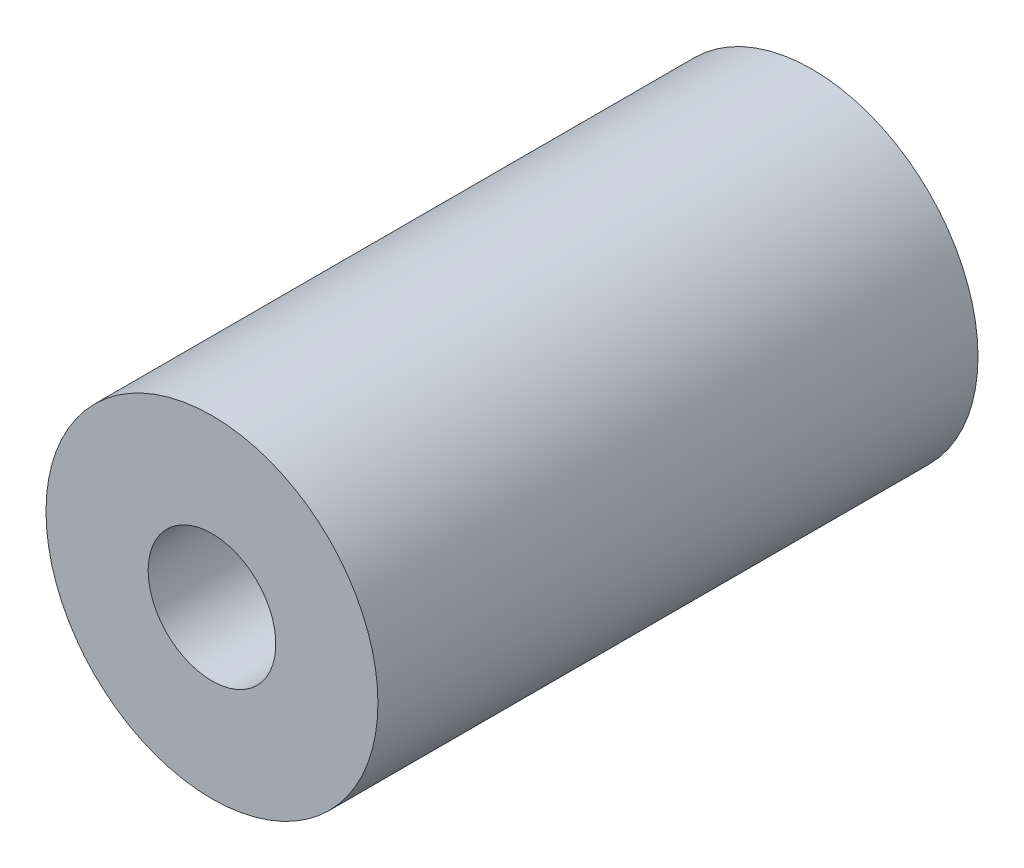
ISO-10303-21;
HEADER;
FILE_DESCRIPTION(('STEP AP214'),'2;1');
FILE_NAME('part.step','',(''),(''),'','','');
FILE_SCHEMA(('AUTOMOTIVE_DESIGN { 1 0 10303 214 1 1 1 1 }'));
ENDSEC;
DATA;
#1=APPLICATION_CONTEXT('core data for automotive mechanical design processes');
#2=APPLICATION_PROTOCOL_DEFINITION('international standard','automotive_design',2000,#1);
#3=PRODUCT_CONTEXT('',#1,'mechanical');
#4=PRODUCT('Part','Part','',(#3));
#5=PRODUCT_RELATED_PRODUCT_CATEGORY('part','',(#4));
#6=PRODUCT_DEFINITION_FORMATION('','',#4);
#7=PRODUCT_DEFINITION_CONTEXT('part definition',#1,'design');
#8=PRODUCT_DEFINITION('design','',#6,#7);
#9=PRODUCT_DEFINITION_SHAPE('','',#8);
#10=(LENGTH_UNIT() NAMED_UNIT(*) SI_UNIT(.MILLI.,.METRE.));
#11=(NAMED_UNIT(*) PLANE_ANGLE_UNIT() SI_UNIT($,.RADIAN.));
#12=(NAMED_UNIT(*) SI_UNIT($,.STERADIAN.) SOLID_ANGLE_UNIT());
#13=UNCERTAINTY_MEASURE_WITH_UNIT(LENGTH_MEASURE(1.E-05),#10,'distance_accuracy_value','');
#14=(GEOMETRIC_REPRESENTATION_CONTEXT(3) GLOBAL_UNCERTAINTY_ASSIGNED_CONTEXT((#13)) GLOBAL_UNIT_ASSIGNED_CONTEXT((#10,
#11,#12)) REPRESENTATION_CONTEXT('',''));
#15=CARTESIAN_POINT('',(0.,0.,0.));
#16=DIRECTION('',(0.,0.,1.));
#17=DIRECTION('',(1.,0.,0.));
#18=AXIS2_PLACEMENT_3D('',#15,#16,#17);
#19=CARTESIAN_POINT('',(0.,0.,45.));
#20=DIRECTION('',(0.,0.,1.));
#21=DIRECTION('',(1.,0.,0.));
#22=AXIS2_PLACEMENT_3D('',#19,#20,#21);
#23=CYLINDRICAL_SURFACE('',#22,6.5);
#24=CARTESIAN_POINT('',(0.,0.,25.));
#25=DIRECTION('',(0.,0.,1.));
#26=DIRECTION('',(1.,0.,0.));
#27=AXIS2_PLACEMENT_3D('',#24,#25,#26);
#28=CIRCLE('',#27,6.5);
#29=CARTESIAN_POINT('',(6.5,0.,25.));
#30=VERTEX_POINT('',#29);
#31=EDGE_CURVE('E8',#30,#30,#28,.T.);
#32=ORIENTED_EDGE('',*,*,#31,.F.);
#33=EDGE_LOOP('',(#32));
#34=FACE_BOUND('',#33,.T.);
#35=CARTESIAN_POINT('',(0.,0.,1.5));
#36=DIRECTION('',(0.,0.,-1.));
#37=DIRECTION('',(-1.,0.,0.));
#38=AXIS2_PLACEMENT_3D('',#35,#36,#37);
#39=CIRCLE('',#38,6.5);
#40=CARTESIAN_POINT('',(-6.5,0.,1.5));
#41=VERTEX_POINT('',#40);
#42=EDGE_CURVE('E28',#41,#41,#39,.F.);
#43=ORIENTED_EDGE('',*,*,#42,.T.);
#44=EDGE_LOOP('',(#43));
#45=FACE_BOUND('',#44,.T.);
#46=ADVANCED_FACE('F12',(#34,#45),#23,.T.);
#47=CARTESIAN_POINT('',(0.,0.,25.));
#48=DIRECTION('',(0.,0.,1.));
#49=DIRECTION('',(1.,0.,0.));
#50=AXIS2_PLACEMENT_3D('',#47,#48,#49);
#51=PLANE('',#50);
#52=ORIENTED_EDGE('',*,*,#31,.T.);
#53=EDGE_LOOP('',(#52));
#54=FACE_BOUND('',#53,.T.);
#55=CARTESIAN_POINT('',(0.,0.,25.));
#56=DIRECTION('',(0.,0.,-1.));
#57=DIRECTION('',(-1.,0.,0.));
#58=AXIS2_PLACEMENT_3D('',#55,#56,#57);
#59=CIRCLE('',#58,2.5);
#60=CARTESIAN_POINT('',(-2.5,0.,25.));
#61=VERTEX_POINT('',#60);
#62=EDGE_CURVE('E25',#61,#61,#59,.T.);
#63=ORIENTED_EDGE('',*,*,#62,.T.);
#64=EDGE_LOOP('',(#63));
#65=FACE_BOUND('',#64,.T.);
#66=ADVANCED_FACE('F41',(#54,#65),#51,.T.);
#67=CARTESIAN_POINT('',(0.,0.,16.));
#68=DIRECTION('',(0.,0.,1.));
#69=DIRECTION('',(1.,0.,0.));
#70=AXIS2_PLACEMENT_3D('',#67,#68,#69);
#71=CYLINDRICAL_SURFACE('',#70,2.5);
#72=CARTESIAN_POINT('',(0.,0.,16.));
#73=DIRECTION('',(0.,0.,-1.));
#74=DIRECTION('',(-1.,0.,0.));
#75=AXIS2_PLACEMENT_3D('',#72,#73,#74);
#76=CIRCLE('',#75,2.5);
#77=CARTESIAN_POINT('',(-2.5,0.,16.));
#78=VERTEX_POINT('',#77);
#79=EDGE_CURVE('E20',#78,#78,#76,.T.);
#80=ORIENTED_EDGE('',*,*,#79,.T.);
#81=EDGE_LOOP('',(#80));
#82=FACE_BOUND('',#81,.T.);
#83=ORIENTED_EDGE('',*,*,#62,.F.);
#84=EDGE_LOOP('',(#83));
#85=FACE_BOUND('',#84,.T.);
#86=ADVANCED_FACE('F43',(#82,#85),#71,.F.);
#87=CARTESIAN_POINT('',(0.,0.,16.));
#88=DIRECTION('',(0.,0.,-1.));
#89=DIRECTION('',(-1.,0.,0.));
#90=AXIS2_PLACEMENT_3D('',#87,#88,#89);
#91=PLANE('',#90);
#92=ORIENTED_EDGE('',*,*,#79,.F.);
#93=EDGE_LOOP('',(#92));
#94=FACE_BOUND('',#93,.T.);
#95=ADVANCED_FACE('F45',(#94),#91,.F.);
#96=CARTESIAN_POINT('',(0.,0.,-15.));
#97=DIRECTION('',(0.,0.,-1.));
#98=DIRECTION('',(-1.,0.,0.));
#99=AXIS2_PLACEMENT_3D('',#96,#97,#98);
#100=CYLINDRICAL_SURFACE('',#99,4.25);
#101=CARTESIAN_POINT('',(0.,0.,0.));
#102=DIRECTION('',(0.,0.,-1.));
#103=DIRECTION('',(-1.,0.,0.));
#104=AXIS2_PLACEMENT_3D('',#101,#102,#103);
#105=CIRCLE('',#104,4.25);
#106=CARTESIAN_POINT('',(-4.25,0.,0.));
#107=VERTEX_POINT('',#106);
#108=EDGE_CURVE('E16',#107,#107,#105,.F.);
#109=ORIENTED_EDGE('',*,*,#108,.T.);
#110=EDGE_LOOP('',(#109));
#111=FACE_BOUND('',#110,.T.);
#112=CARTESIAN_POINT('',(0.,0.,1.5));
#113=DIRECTION('',(0.,0.,-1.));
#114=DIRECTION('',(-1.,0.,0.));
#115=AXIS2_PLACEMENT_3D('',#112,#113,#114);
#116=CIRCLE('',#115,4.25);
#117=CARTESIAN_POINT('',(-4.25,0.,1.5));
#118=VERTEX_POINT('',#117);
#119=EDGE_CURVE('E30',#118,#118,#116,.T.);
#120=ORIENTED_EDGE('',*,*,#119,.T.);
#121=EDGE_LOOP('',(#120));
#122=FACE_BOUND('',#121,.T.);
#123=ADVANCED_FACE('F48',(#111,#122),#100,.T.);
#124=CARTESIAN_POINT('',(0.,4.25,1.5));
#125=DIRECTION('',(0.,0.,-1.));
#126=DIRECTION('',(-1.,0.,0.));
#127=AXIS2_PLACEMENT_3D('',#124,#125,#126);
#128=PLANE('',#127);
#129=ORIENTED_EDGE('',*,*,#42,.F.);
#130=EDGE_LOOP('',(#129));
#131=FACE_BOUND('',#130,.T.);
#132=ORIENTED_EDGE('',*,*,#119,.F.);
#133=EDGE_LOOP('',(#132));
#134=FACE_BOUND('',#133,.T.);
#135=ADVANCED_FACE('F58',(#131,#134),#128,.T.);
#136=CARTESIAN_POINT('',(6.5,0.,0.));
#137=DIRECTION('',(0.,0.,-1.));
#138=DIRECTION('',(-1.,0.,0.));
#139=AXIS2_PLACEMENT_3D('',#136,#137,#138);
#140=PLANE('',#139);
#141=ORIENTED_EDGE('',*,*,#108,.F.);
#142=EDGE_LOOP('',(#141));
#143=FACE_BOUND('',#142,.T.);
#144=ADVANCED_FACE('F14',(#143),#140,.T.);
#145=CLOSED_SHELL('',(#46,#66,#86,#95,#123,#135,#144));
#146=MANIFOLD_SOLID_BREP('B1',#145);
#147=ADVANCED_BREP_SHAPE_REPRESENTATION('',(#18,#146),#14);
#148=SHAPE_DEFINITION_REPRESENTATION(#9,#147);
ENDSEC;
END-ISO-10303-21;
